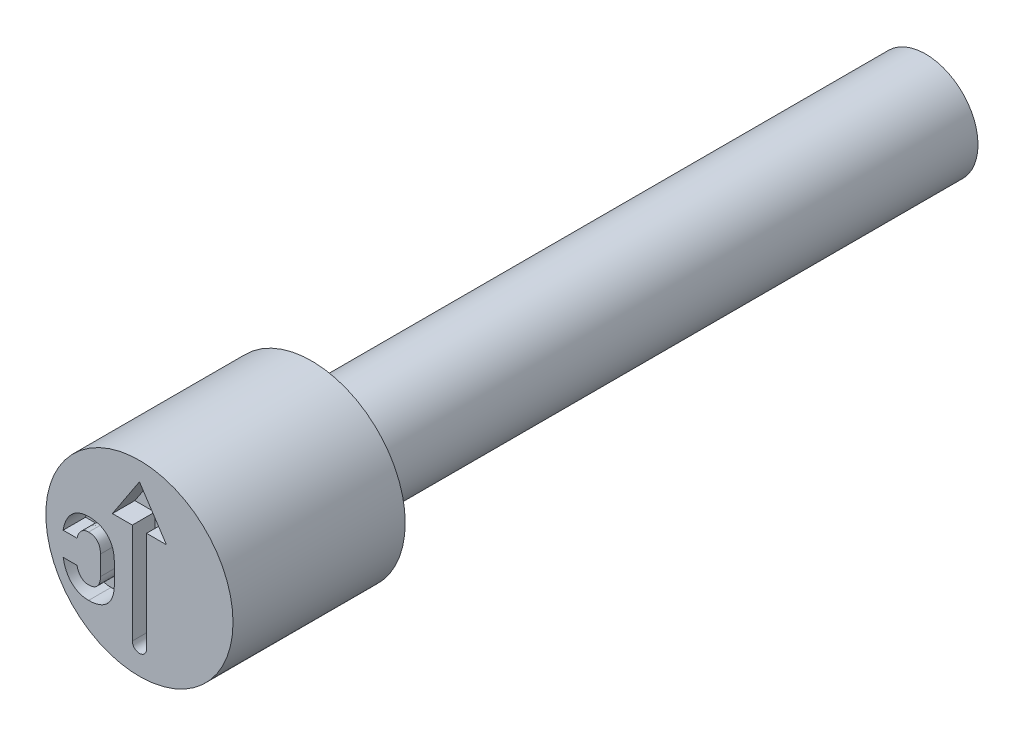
from build123d import *

# Parameters (mm, degrees)
CUT_EXTRUDE4_DEPTH = 0.3
CUT_EXTRUDE5_DEPTH = 0.3


with BuildPart() as part:
    # Sketch2 → Revolve1 (revolve)
    with BuildSketch(Plane(origin=(0, 0, 0), x_dir=(0, 0, -1), z_dir=(1, 0, 0)), mode=Mode.PRIVATE) as revolve1_sk:
        Polygon((0, 1.25), (0, 0), (10.5, 0), (10.5, 0.7), (2.3, 0.7), (2.3, 1.25), align=None)
    revolve(revolve1_sk.sketch.rotate(Axis((0, 0, -0.403888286), (0, 0, -1)), 90), axis=Axis((0, 0, -0.403888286), (0, 0, -1)))

    # Sketch3 → Cut-Extrude4 (cut)
    with BuildSketch(Plane.XY):
        with BuildLine():
            Line((0.095236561, 0.453175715), (0.095236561, -0.888080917))
            ThreePointArc((0.095236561, -0.888080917), (0, -0.983317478), (-0.095236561, -0.888080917))
            Line((-0.095236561, -0.888080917), (-0.095236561, 0.453175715))
            Line((-0.095236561, 0.453175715), (-0.360958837, 0.453175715))
            Line((-0.360958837, 0.453175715), (0, 1.001057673))
            Line((0, 1.001057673), (0.360958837, 0.453175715))
            Line((0.360958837, 0.453175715), (0.095236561, 0.453175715))
        make_face()
    extrude(amount=-CUT_EXTRUDE4_DEPTH, mode=Mode.SUBTRACT)

    # Sketch4 → Cut-Extrude5 (cut)
    with BuildSketch(Plane.XY):
        with BuildLine():
            add(Edge.make_bspline(
                [(-0.678632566, -0.70987365), (-0.669787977, -0.70977798), (-0.652334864, -0.709589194), (-0.626671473, -0.707624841), (-0.601912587, -0.704341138), (-0.578193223, -0.699710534), (-0.555447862, -0.693868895), (-0.533579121, -0.686964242), (-0.512797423, -0.678416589), (-0.492901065, -0.66872339), (-0.474170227, -0.657752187), (-0.456644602, -0.645411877), (-0.440150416, -0.632089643), (-0.424812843, -0.617518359), (-0.410647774, -0.601783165), (-0.397574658, -0.584866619), (-0.385862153, -0.566660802), (-0.375147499, -0.547411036), (-0.365614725, -0.527064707), (-0.357568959, -0.505524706), (-0.350593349, -0.48302888), (-0.344758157, -0.459580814), (-0.340290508, -0.43507393), (-0.337312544, -0.409526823), (-0.335248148, -0.382915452), (-0.33507775, -0.364816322), (-0.334990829, -0.35558386)],
                knots=[0, 0, 0, 0, 1.134237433, 2.238201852, 3.298772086, 4.336057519, 5.335809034, 6.309558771, 7.274828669, 8.21507465, 9.146315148, 10.055631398, 10.961815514, 11.863452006, 12.765999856, 13.674901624, 14.60241943, 15.539819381, 16.498894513, 17.481225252, 18.486546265, 19.518401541, 20.578551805, 21.679128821, 22.816111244, 24, 24, 24, 24], degree=3))
            Line((-0.334990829, -0.35558386), (-0.334990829, -0.094996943))
            add(Edge.make_bspline(
                [(-0.334990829, -0.094996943), (-0.33507775, -0.085764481), (-0.335248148, -0.067665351), (-0.337312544, -0.04105398), (-0.340290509, -0.015506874), (-0.344758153, 0.009000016), (-0.350593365, 0.032448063), (-0.357568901, 0.054943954), (-0.365614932, 0.076483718), (-0.375146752, 0.096830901), (-0.385864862, 0.116077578), (-0.397564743, 0.134294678), (-0.41071339, 0.151208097), (-0.424743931, 0.167128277), (-0.440159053, 0.181695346), (-0.456644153, 0.195022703), (-0.474163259, 0.207380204), (-0.492955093, 0.218289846), (-0.51273686, 0.22828656), (-0.533626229, 0.23669875), (-0.555404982, 0.243933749), (-0.578199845, 0.249690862), (-0.601910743, 0.254346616), (-0.626671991, 0.257623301), (-0.652334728, 0.259589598), (-0.669787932, 0.259778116), (-0.678632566, 0.25987365)],
                knots=[0, 0, 0, 0, 1.183277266, 2.319672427, 3.419680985, 4.479283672, 5.510605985, 6.515407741, 7.497231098, 8.455810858, 9.392726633, 10.319765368, 11.22819768, 12.136441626, 13.037612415, 13.943328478, 14.852175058, 15.782934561, 16.726365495, 17.691136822, 18.666946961, 19.666182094, 20.70293176, 21.7629542, 22.866348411, 24, 24, 24, 24], degree=3))
            add(Edge.make_bspline(
                [(-0.678632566, 0.25987365), (-0.693187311, 0.259484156), (-0.721718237, 0.258720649), (-0.763185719, 0.251054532), (-0.802344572, 0.239119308), (-0.838965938, 0.222100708), (-0.87293517, 0.200628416), (-0.903854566, 0.174503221), (-0.931713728, 0.144067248), (-0.956272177, 0.10919605), (-0.977599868, 0.070376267), (-0.995157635, 0.027603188), (-1.009409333, -0.018804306), (-1.015734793, -0.05136541), (-1.018983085, -0.068086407)],
                knots=[0, 0, 0, 0, 1.00806925, 1.976066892, 2.912865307, 3.839664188, 4.766819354, 5.690806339, 6.637604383, 7.619531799, 8.640729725, 9.701744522, 10.819784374, 12, 12, 12, 12], degree=3))
            Line((-1.018983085, -0.068086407), (-0.833513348, -0.068086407))
            add(Edge.make_bspline(
                [(-0.833513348, -0.068086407), (-0.831642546, -0.060497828), (-0.828002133, -0.045731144), (-0.820506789, -0.024724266), (-0.811983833, -0.005266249), (-0.80156028, 0.012179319), (-0.790213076, 0.028033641), (-0.777416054, 0.041769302), (-0.763449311, 0.053614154), (-0.748420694, 0.063410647), (-0.73237113, 0.071394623), (-0.715227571, 0.076678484), (-0.697226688, 0.080128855), (-0.684908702, 0.08056866), (-0.678632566, 0.080792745)],
                knots=[0, 0, 0, 0, 1.203096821, 2.341117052, 3.431111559, 4.469295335, 5.465369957, 6.42892467, 7.35290722, 8.279239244, 9.186115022, 10.104036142, 11.033987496, 12, 12, 12, 12], degree=3))
            add(Edge.make_bspline(
                [(-0.678632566, 0.080792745), (-0.670554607, 0.080509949), (-0.654955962, 0.079963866), (-0.632358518, 0.076406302), (-0.611774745, 0.069704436), (-0.592917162, 0.060813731), (-0.576071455, 0.049298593), (-0.561418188, 0.035182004), (-0.548949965, 0.018655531), (-0.53844371, 3.579e-06), (-0.530320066, -0.020932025), (-0.52460416, -0.043892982), (-0.521067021, -0.068815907), (-0.52066714, -0.086079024), (-0.520460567, -0.094996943)],
                knots=[0, 0, 0, 0, 1.082677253, 2.090664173, 3.053339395, 3.973921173, 4.875832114, 5.774919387, 6.688160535, 7.640683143, 8.634736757, 9.687648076, 10.805466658, 12, 12, 12, 12], degree=3))
            Line((-0.520460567, -0.094996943), (-0.520460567, -0.35558386))
            add(Edge.make_bspline(
                [(-0.520460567, -0.35558386), (-0.520669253, -0.364501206), (-0.521073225, -0.381763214), (-0.52457301, -0.406631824), (-0.530363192, -0.429507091), (-0.538396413, -0.450350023), (-0.548948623, -0.468863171), (-0.561480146, -0.485196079), (-0.576063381, -0.499309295), (-0.592924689, -0.510792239), (-0.611734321, -0.51977432), (-0.632420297, -0.526088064), (-0.654927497, -0.53005134), (-0.670548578, -0.530539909), (-0.678632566, -0.530792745)],
                knots=[0, 0, 0, 0, 1.196920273, 2.316972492, 3.363591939, 4.359631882, 5.306515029, 6.214703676, 7.115587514, 8.019300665, 8.94172196, 9.903709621, 10.915159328, 12, 12, 12, 12], degree=3))
            add(Edge.make_bspline(
                [(-0.678632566, -0.530792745), (-0.685031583, -0.530540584), (-0.697582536, -0.530045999), (-0.715918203, -0.527018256), (-0.733181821, -0.521438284), (-0.749489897, -0.513920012), (-0.764722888, -0.504206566), (-0.778446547, -0.492205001), (-0.791229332, -0.478543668), (-0.802606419, -0.462777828), (-0.812691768, -0.445134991), (-0.821125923, -0.425608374), (-0.828447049, -0.404415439), (-0.831789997, -0.389440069), (-0.833513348, -0.381719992)],
                knots=[0, 0, 0, 0, 0.981077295, 1.924272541, 2.837745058, 3.753838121, 4.670304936, 5.59622504, 6.54113043, 7.532377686, 8.569122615, 9.649813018, 10.788435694, 12, 12, 12, 12], degree=3))
            Line((-0.833513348, -0.381719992), (-1.018983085, -0.381719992))
            add(Edge.make_bspline(
                [(-1.018983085, -0.381719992), (-1.015674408, -0.398507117), (-1.009241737, -0.431144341), (-0.994786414, -0.477622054), (-0.976972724, -0.520324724), (-0.955773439, -0.559188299), (-0.931059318, -0.593828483), (-0.903421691, -0.624374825), (-0.872627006, -0.650569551), (-0.838738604, -0.672149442), (-0.802147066, -0.689114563), (-0.763052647, -0.701028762), (-0.721656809, -0.708736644), (-0.693188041, -0.709488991), (-0.678632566, -0.70987365)],
                knots=[0, 0, 0, 0, 1.185884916, 2.305575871, 3.368634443, 4.390138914, 5.368714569, 6.312778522, 7.23993122, 8.163588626, 9.090665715, 10.027745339, 10.991628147, 12, 12, 12, 12], degree=3))
        make_face()
    extrude(amount=-CUT_EXTRUDE5_DEPTH, mode=Mode.SUBTRACT)


solid = part.part
